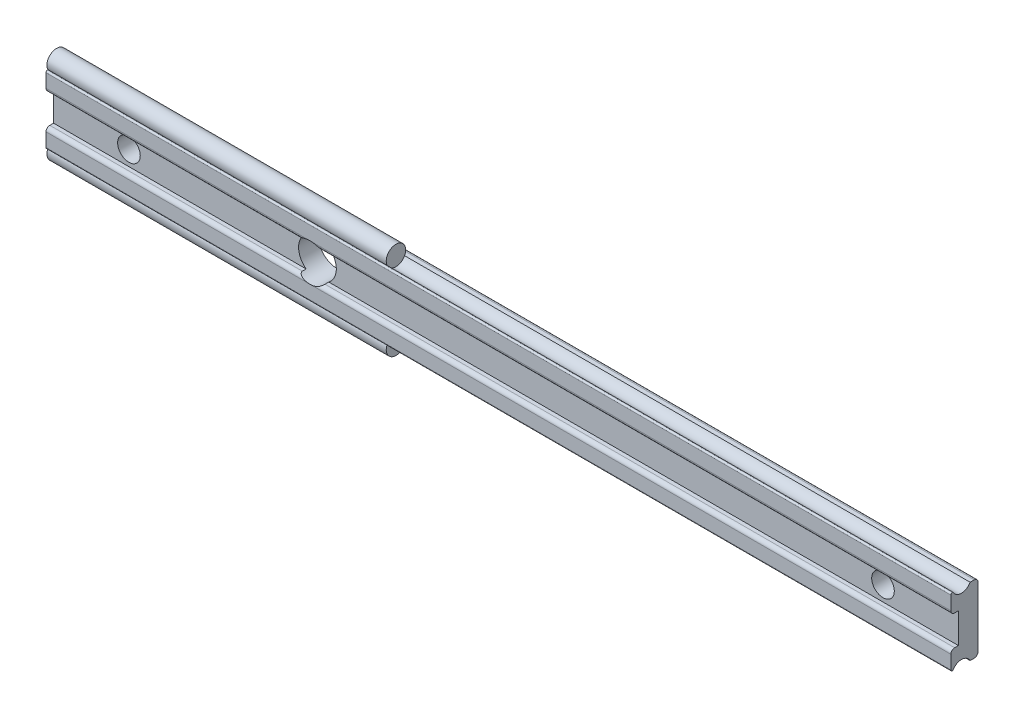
ISO-10303-21;
HEADER;
FILE_DESCRIPTION(('STEP AP214'),'2;1');
FILE_NAME('part.step','',(''),(''),'','','');
FILE_SCHEMA(('AUTOMOTIVE_DESIGN { 1 0 10303 214 1 1 1 1 }'));
ENDSEC;
DATA;
#1=APPLICATION_CONTEXT('core data for automotive mechanical design processes');
#2=APPLICATION_PROTOCOL_DEFINITION('international standard','automotive_design',2000,#1);
#3=PRODUCT_CONTEXT('',#1,'mechanical');
#4=PRODUCT('Part','Part','',(#3));
#5=PRODUCT_RELATED_PRODUCT_CATEGORY('part','',(#4));
#6=PRODUCT_DEFINITION_FORMATION('','',#4);
#7=PRODUCT_DEFINITION_CONTEXT('part definition',#1,'design');
#8=PRODUCT_DEFINITION('design','',#6,#7);
#9=PRODUCT_DEFINITION_SHAPE('','',#8);
#10=(LENGTH_UNIT() NAMED_UNIT(*) SI_UNIT(.MILLI.,.METRE.));
#11=(NAMED_UNIT(*) PLANE_ANGLE_UNIT() SI_UNIT($,.RADIAN.));
#12=(NAMED_UNIT(*) SI_UNIT($,.STERADIAN.) SOLID_ANGLE_UNIT());
#13=UNCERTAINTY_MEASURE_WITH_UNIT(LENGTH_MEASURE(1.E-05),#10,'distance_accuracy_value','');
#14=(GEOMETRIC_REPRESENTATION_CONTEXT(3) GLOBAL_UNCERTAINTY_ASSIGNED_CONTEXT((#13)) GLOBAL_UNIT_ASSIGNED_CONTEXT((#10,
#11,#12)) REPRESENTATION_CONTEXT('',''));
#15=CARTESIAN_POINT('',(0.,0.,0.));
#16=DIRECTION('',(0.,0.,1.));
#17=DIRECTION('',(1.,0.,0.));
#18=AXIS2_PLACEMENT_3D('',#15,#16,#17);
#19=CARTESIAN_POINT('',(-10.,-5.10000002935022,2.18999997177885));
#20=DIRECTION('',(1.,0.,0.));
#21=DIRECTION('',(0.,0.,-1.));
#22=AXIS2_PLACEMENT_3D('',#19,#20,#21);
#23=CYLINDRICAL_SURFACE('',#22,1.28999999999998);
#24=DIRECTION('',(1.,0.,0.));
#25=VECTOR('',#24,1.);
#26=CARTESIAN_POINT('',(-10.,-4.50000002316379,3.33197194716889));
#27=LINE('',#26,#25);
#28=CARTESIAN_POINT('',(35.,-4.50000002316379,3.33197194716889));
#29=VERTEX_POINT('',#28);
#30=CARTESIAN_POINT('',(110.,-4.50000002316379,3.33197194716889));
#31=VERTEX_POINT('',#30);
#32=EDGE_CURVE('E36',#29,#31,#27,.T.);
#33=ORIENTED_EDGE('',*,*,#32,.F.);
#34=CARTESIAN_POINT('',(35.,-5.10000002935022,2.18999997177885));
#35=DIRECTION('',(-1.,0.,0.));
#36=DIRECTION('',(0.,0.,1.));
#37=AXIS2_PLACEMENT_3D('',#34,#35,#36);
#38=CIRCLE('',#37,1.28999999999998);
#39=CARTESIAN_POINT('',(35.,-4.50000002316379,1.04802799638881));
#40=VERTEX_POINT('',#39);
#41=EDGE_CURVE('E31',#29,#40,#38,.T.);
#42=ORIENTED_EDGE('',*,*,#41,.T.);
#43=DIRECTION('',(1.,0.,0.));
#44=VECTOR('',#43,1.);
#45=CARTESIAN_POINT('',(-10.,-4.50000002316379,1.04802799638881));
#46=LINE('',#45,#44);
#47=CARTESIAN_POINT('',(110.,-4.50000002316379,1.04802799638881));
#48=VERTEX_POINT('',#47);
#49=EDGE_CURVE('E199',#40,#48,#46,.T.);
#50=ORIENTED_EDGE('',*,*,#49,.T.);
#51=CARTESIAN_POINT('',(110.,-5.10000002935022,2.18999997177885));
#52=DIRECTION('',(-1.,0.,0.));
#53=DIRECTION('',(0.,0.,1.));
#54=AXIS2_PLACEMENT_3D('',#51,#52,#53);
#55=CIRCLE('',#54,1.28999999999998);
#56=EDGE_CURVE('E343',#31,#48,#55,.T.);
#57=ORIENTED_EDGE('',*,*,#56,.F.);
#58=EDGE_LOOP('',(#33,#42,#50,#57));
#59=FACE_BOUND('',#58,.T.);
#60=ADVANCED_FACE('F14',(#59),#23,.F.);
#61=CARTESIAN_POINT('',(-10.,5.10000002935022,2.18999997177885));
#62=DIRECTION('',(1.,0.,0.));
#63=DIRECTION('',(0.,0.,-1.));
#64=AXIS2_PLACEMENT_3D('',#61,#62,#63);
#65=CYLINDRICAL_SURFACE('',#64,1.28999999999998);
#66=DIRECTION('',(1.,0.,0.));
#67=VECTOR('',#66,1.);
#68=CARTESIAN_POINT('',(-10.,4.50000002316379,1.04802799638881));
#69=LINE('',#68,#67);
#70=CARTESIAN_POINT('',(35.,4.50000002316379,1.04802799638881));
#71=VERTEX_POINT('',#70);
#72=CARTESIAN_POINT('',(110.,4.50000002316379,1.04802799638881));
#73=VERTEX_POINT('',#72);
#74=EDGE_CURVE('E434',#71,#73,#69,.T.);
#75=ORIENTED_EDGE('',*,*,#74,.F.);
#76=CARTESIAN_POINT('',(35.,5.10000002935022,2.18999997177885));
#77=DIRECTION('',(-1.,0.,0.));
#78=DIRECTION('',(0.,0.,1.));
#79=AXIS2_PLACEMENT_3D('',#76,#77,#78);
#80=CIRCLE('',#79,1.28999999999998);
#81=CARTESIAN_POINT('',(35.,4.50000002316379,3.33197194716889));
#82=VERTEX_POINT('',#81);
#83=EDGE_CURVE('E215',#71,#82,#80,.T.);
#84=ORIENTED_EDGE('',*,*,#83,.T.);
#85=DIRECTION('',(1.,0.,0.));
#86=VECTOR('',#85,1.);
#87=CARTESIAN_POINT('',(-10.,4.50000002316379,3.33197194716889));
#88=LINE('',#87,#86);
#89=CARTESIAN_POINT('',(110.,4.50000002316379,3.33197194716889));
#90=VERTEX_POINT('',#89);
#91=EDGE_CURVE('E431',#82,#90,#88,.T.);
#92=ORIENTED_EDGE('',*,*,#91,.T.);
#93=CARTESIAN_POINT('',(110.,5.10000002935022,2.18999997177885));
#94=DIRECTION('',(-1.,0.,0.));
#95=DIRECTION('',(0.,0.,-1.));
#96=AXIS2_PLACEMENT_3D('',#93,#94,#95);
#97=CIRCLE('',#96,1.28999999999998);
#98=EDGE_CURVE('E446',#73,#90,#97,.T.);
#99=ORIENTED_EDGE('',*,*,#98,.F.);
#100=EDGE_LOOP('',(#75,#84,#92,#99));
#101=FACE_BOUND('',#100,.T.);
#102=ADVANCED_FACE('F296',(#101),#65,.F.);
#103=CARTESIAN_POINT('',(-10.,-2.50000002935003,3.0999999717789));
#104=DIRECTION('',(1.,0.,0.));
#105=DIRECTION('',(0.,0.,-1.));
#106=AXIS2_PLACEMENT_3D('',#103,#104,#105);
#107=CYLINDRICAL_SURFACE('',#106,0.5);
#108=CARTESIAN_POINT('',(23.5000000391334,-2.00000002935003,3.0999999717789));
#109=CARTESIAN_POINT('',(23.4999623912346,-1.99996207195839,3.11987287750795));
#110=CARTESIAN_POINT('',(23.5015761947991,-2.00118249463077,3.13968780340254));
#111=CARTESIAN_POINT('',(23.5077735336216,-2.00581273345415,3.17838692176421));
#112=CARTESIAN_POINT('',(23.5123272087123,-2.00920053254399,3.19727844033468));
#113=CARTESIAN_POINT('',(23.524064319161,-2.01783620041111,3.23368112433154));
#114=CARTESIAN_POINT('',(23.5312395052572,-2.02307823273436,3.25119641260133));
#115=CARTESIAN_POINT('',(23.5478060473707,-2.03500322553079,3.28464478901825));
#116=CARTESIAN_POINT('',(23.5572029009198,-2.04168975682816,3.30057381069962));
#117=CARTESIAN_POINT('',(23.5821801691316,-2.05915126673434,3.33710629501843));
#118=CARTESIAN_POINT('',(23.5986909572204,-2.07045578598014,3.35681757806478));
#119=CARTESIAN_POINT('',(23.6343735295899,-2.09416519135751,3.39285662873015));
#120=CARTESIAN_POINT('',(23.6535504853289,-2.10657219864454,3.40917766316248));
#121=CARTESIAN_POINT('',(23.7057779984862,-2.13925431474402,3.44760067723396));
#122=CARTESIAN_POINT('',(23.7403171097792,-2.15983620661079,3.46739923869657));
#123=CARTESIAN_POINT('',(23.8124646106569,-2.20033841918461,3.50112098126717));
#124=CARTESIAN_POINT('',(23.8500797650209,-2.22025713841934,3.51503077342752));
#125=CARTESIAN_POINT('',(23.924642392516,-2.25725862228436,3.53761969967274));
#126=CARTESIAN_POINT('',(23.9614526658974,-2.27444229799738,3.54659655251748));
#127=CARTESIAN_POINT('',(24.036377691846,-2.30718587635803,3.5616792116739));
#128=CARTESIAN_POINT('',(24.0744935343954,-2.32274437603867,3.56778255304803));
#129=CARTESIAN_POINT('',(24.1517657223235,-2.35206511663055,3.57786589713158));
#130=CARTESIAN_POINT('',(24.1909240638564,-2.36582356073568,3.58184146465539));
#131=CARTESIAN_POINT('',(24.2699963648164,-2.3914061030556,3.58824225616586));
#132=CARTESIAN_POINT('',(24.309910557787,-2.40322959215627,3.59066699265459));
#133=CARTESIAN_POINT('',(24.4163047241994,-2.43187057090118,3.59567017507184));
#134=CARTESIAN_POINT('',(24.4832923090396,-2.44698126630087,3.59733638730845));
#135=CARTESIAN_POINT('',(24.6183198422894,-2.47164651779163,3.59934733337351));
#136=CARTESIAN_POINT('',(24.6863603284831,-2.48119813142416,3.59969136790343));
#137=CARTESIAN_POINT('',(24.8231051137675,-2.49468127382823,3.60001763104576));
#138=CARTESIAN_POINT('',(24.8918102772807,-2.49860408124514,3.59999929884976));
#139=CARTESIAN_POINT('',(25.0292885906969,-2.50077334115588,3.60000045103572));
#140=CARTESIAN_POINT('',(25.0980617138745,-2.49902150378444,3.60001992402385));
#141=CARTESIAN_POINT('',(25.2361894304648,-2.48979369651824,3.59991747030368));
#142=CARTESIAN_POINT('',(25.3055387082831,-2.48223803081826,3.59979356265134));
#143=CARTESIAN_POINT('',(25.4434132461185,-2.46135084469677,3.59861400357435));
#144=CARTESIAN_POINT('',(25.5119378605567,-2.44801506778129,3.5975576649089));
#145=CARTESIAN_POINT('',(25.647193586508,-2.41577094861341,3.59312171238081));
#146=CARTESIAN_POINT('',(25.7139325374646,-2.39689392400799,3.58975501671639));
#147=CARTESIAN_POINT('',(25.8452354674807,-2.35378973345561,3.57866700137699));
#148=CARTESIAN_POINT('',(25.9098033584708,-2.32957285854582,3.57095401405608));
#149=CARTESIAN_POINT('',(26.0068972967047,-2.28856748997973,3.55336413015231));
#150=CARTESIAN_POINT('',(26.0405930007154,-2.27343563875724,3.54608306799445));
#151=CARTESIAN_POINT('',(26.1067254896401,-2.24198497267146,3.5286641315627));
#152=CARTESIAN_POINT('',(26.1391613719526,-2.22566533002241,3.51852425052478));
#153=CARTESIAN_POINT('',(26.2024883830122,-2.19210294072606,3.49449855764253));
#154=CARTESIAN_POINT('',(26.233366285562,-2.17485425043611,3.48058554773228));
#155=CARTESIAN_POINT('',(26.2924927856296,-2.14023972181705,3.44804575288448));
#156=CARTESIAN_POINT('',(26.3207460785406,-2.12287415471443,3.4294276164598));
#157=CARTESIAN_POINT('',(26.3636912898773,-2.09540988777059,3.39428778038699));
#158=CARTESIAN_POINT('',(26.3795669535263,-2.08497392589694,3.3794847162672));
#159=CARTESIAN_POINT('',(26.4092206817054,-2.06504577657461,3.34732961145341));
#160=CARTESIAN_POINT('',(26.4230004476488,-2.05555282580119,3.3299796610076));
#161=CARTESIAN_POINT('',(26.4458455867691,-2.03953296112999,3.29562678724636));
#162=CARTESIAN_POINT('',(26.4553118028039,-2.03277439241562,3.27900168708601));
#163=CARTESIAN_POINT('',(26.4718168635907,-2.02085580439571,3.24408352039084));
#164=CARTESIAN_POINT('',(26.4788617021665,-2.01569184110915,3.22579471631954));
#165=CARTESIAN_POINT('',(26.4895121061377,-2.00783357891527,3.18984795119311));
#166=CARTESIAN_POINT('',(26.4933960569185,-2.00494048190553,3.17231727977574));
#167=CARTESIAN_POINT('',(26.4986638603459,-2.00100227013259,3.13654134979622));
#168=CARTESIAN_POINT('',(26.5000272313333,-1.9999722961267,3.11829145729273));
#169=CARTESIAN_POINT('',(26.4999999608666,-2.00000002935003,3.0999999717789));
#170=B_SPLINE_CURVE_WITH_KNOTS('',3,(#108,#109,#110,#111,#112,#113,#114,#115,#116,#117,#118,
#119,#120,#121,#122,#123,#124,#125,#126,#127,#128,#129,#130,#131,#132,#133,#134,#135,#136,#137,
#138,#139,#140,#141,#142,#143,#144,#145,#146,#147,#148,#149,#150,#151,#152,#153,#154,#155,#156,
#157,#158,#159,#160,#161,#162,#163,#164,#165,#166,#167,#168,#169),.UNSPECIFIED.,.F.,.F.,(4,2,2,
2,2,2,2,2,2,2,2,2,2,2,2,2,2,2,2,2,2,2,2,2,2,2,2,2,2,2,4),(0.,0.0594240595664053,
0.118253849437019,0.176900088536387,0.23569299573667,0.319483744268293,0.403439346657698,
0.537132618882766,0.671128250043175,0.795755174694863,0.920488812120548,1.04548144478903,
1.17051334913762,1.37630111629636,1.5821977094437,1.78841297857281,1.99456610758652,
2.20360179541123,2.41279168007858,2.62082132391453,2.82845350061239,2.94128618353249,
3.05419826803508,3.16794695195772,3.28148805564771,3.35355275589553,3.42555863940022,
3.48619419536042,3.54667855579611,3.60096706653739,3.65569480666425),.UNSPECIFIED.);
#171=CARTESIAN_POINT('',(23.5000000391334,-2.00000002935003,3.0999999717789));
#172=VERTEX_POINT('',#171);
#173=CARTESIAN_POINT('',(25.,-2.50000002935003,3.5999999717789));
#174=VERTEX_POINT('',#173);
#175=EDGE_CURVE('E258',#172,#174,#170,.T.);
#176=ORIENTED_EDGE('',*,*,#175,.F.);
#177=DIRECTION('',(1.,0.,0.));
#178=VECTOR('',#177,1.);
#179=CARTESIAN_POINT('',(-10.,-2.00000002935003,3.0999999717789));
#180=LINE('',#179,#178);
#181=CARTESIAN_POINT('',(-10.,-2.00000002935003,3.0999999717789));
#182=VERTEX_POINT('',#181);
#183=EDGE_CURVE('E404',#182,#172,#180,.T.);
#184=ORIENTED_EDGE('',*,*,#183,.F.);
#185=CARTESIAN_POINT('',(-10.,-2.50000002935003,3.0999999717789));
#186=DIRECTION('',(1.,0.,0.));
#187=DIRECTION('',(0.,0.,1.));
#188=AXIS2_PLACEMENT_3D('',#185,#186,#187);
#189=CIRCLE('',#188,0.5);
#190=CARTESIAN_POINT('',(-10.,-2.50000002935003,3.5999999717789));
#191=VERTEX_POINT('',#190);
#192=EDGE_CURVE('E381',#182,#191,#189,.T.);
#193=ORIENTED_EDGE('',*,*,#192,.T.);
#194=DIRECTION('',(1.,0.,0.));
#195=VECTOR('',#194,1.);
#196=CARTESIAN_POINT('',(-10.,-2.50000002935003,3.5999999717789));
#197=LINE('',#196,#195);
#198=EDGE_CURVE('E400',#191,#174,#197,.T.);
#199=ORIENTED_EDGE('',*,*,#198,.T.);
#200=EDGE_LOOP('',(#176,#184,#193,#199));
#201=FACE_BOUND('',#200,.T.);
#202=ADVANCED_FACE('F271',(#201),#107,.T.);
#203=CARTESIAN_POINT('',(-10.,-2.00000002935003,3.0999999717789));
#204=DIRECTION('',(0.,1.,0.));
#205=DIRECTION('',(1.,0.,0.));
#206=AXIS2_PLACEMENT_3D('',#203,#204,#205);
#207=PLANE('',#206);
#208=DIRECTION('',(0.,0.,-1.));
#209=VECTOR('',#208,1.);
#210=CARTESIAN_POINT('',(26.4999999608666,-2.00000002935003,3.5999999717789));
#211=LINE('',#210,#209);
#212=CARTESIAN_POINT('',(26.4999999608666,-2.00000002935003,3.0999999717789));
#213=VERTEX_POINT('',#212);
#214=CARTESIAN_POINT('',(26.4999999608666,-2.00000002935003,2.59999996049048));
#215=VERTEX_POINT('',#214);
#216=EDGE_CURVE('E259',#213,#215,#211,.T.);
#217=ORIENTED_EDGE('',*,*,#216,.F.);
#218=CARTESIAN_POINT('',(110.,-2.00000002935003,3.0999999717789));
#219=VERTEX_POINT('',#218);
#220=EDGE_CURVE('E407',#213,#219,#180,.T.);
#221=ORIENTED_EDGE('',*,*,#220,.T.);
#222=DIRECTION('',(0.,0.,1.));
#223=VECTOR('',#222,1.);
#224=CARTESIAN_POINT('',(110.,-2.00000002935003,3.0999999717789));
#225=LINE('',#224,#223);
#226=CARTESIAN_POINT('',(110.,-2.00000002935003,2.59999996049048));
#227=VERTEX_POINT('',#226);
#228=EDGE_CURVE('E338',#227,#219,#225,.T.);
#229=ORIENTED_EDGE('',*,*,#228,.F.);
#230=DIRECTION('',(1.,0.,0.));
#231=VECTOR('',#230,1.);
#232=CARTESIAN_POINT('',(-10.,-2.00000002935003,2.59999996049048));
#233=LINE('',#232,#231);
#234=EDGE_CURVE('E411',#215,#227,#233,.T.);
#235=ORIENTED_EDGE('',*,*,#234,.F.);
#236=EDGE_LOOP('',(#217,#221,#229,#235));
#237=FACE_BOUND('',#236,.T.);
#238=ADVANCED_FACE('F277',(#237),#207,.T.);
#239=CARTESIAN_POINT('',(-10.,-2.00000002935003,2.59999996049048));
#240=DIRECTION('',(0.,0.,1.));
#241=DIRECTION('',(1.,0.,0.));
#242=AXIS2_PLACEMENT_3D('',#239,#240,#241);
#243=PLANE('',#242);
#244=CARTESIAN_POINT('',(0.,0.,2.59999996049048));
#245=DIRECTION('',(0.,0.,1.));
#246=DIRECTION('',(1.,0.,0.));
#247=AXIS2_PLACEMENT_3D('',#244,#245,#246);
#248=CIRCLE('',#247,1.5);
#249=CARTESIAN_POINT('',(1.5,0.,2.59999996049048));
#250=VERTEX_POINT('',#249);
#251=EDGE_CURVE('E716',#250,#250,#248,.T.);
#252=ORIENTED_EDGE('',*,*,#251,.F.);
#253=EDGE_LOOP('',(#252));
#254=FACE_BOUND('',#253,.T.);
#255=CARTESIAN_POINT('',(25.,0.,2.59999996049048));
#256=DIRECTION('',(0.,0.,1.));
#257=DIRECTION('',(1.,0.,0.));
#258=AXIS2_PLACEMENT_3D('',#255,#256,#257);
#259=CIRCLE('',#258,2.5);
#260=CARTESIAN_POINT('',(23.5000000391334,2.00000002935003,2.59999996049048));
#261=VERTEX_POINT('',#260);
#262=CARTESIAN_POINT('',(23.5000000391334,-2.00000002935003,2.59999996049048));
#263=VERTEX_POINT('',#262);
#264=EDGE_CURVE('E485',#261,#263,#259,.T.);
#265=ORIENTED_EDGE('',*,*,#264,.F.);
#266=DIRECTION('',(1.,0.,0.));
#267=VECTOR('',#266,1.);
#268=CARTESIAN_POINT('',(-10.,2.00000002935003,2.59999996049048));
#269=LINE('',#268,#267);
#270=CARTESIAN_POINT('',(-10.,2.00000002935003,2.59999996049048));
#271=VERTEX_POINT('',#270);
#272=EDGE_CURVE('E412',#271,#261,#269,.T.);
#273=ORIENTED_EDGE('',*,*,#272,.F.);
#274=DIRECTION('',(0.,-1.,0.));
#275=VECTOR('',#274,1.);
#276=CARTESIAN_POINT('',(-10.,-2.00000002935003,2.59999996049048));
#277=LINE('',#276,#275);
#278=CARTESIAN_POINT('',(-10.,-2.00000002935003,2.59999996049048));
#279=VERTEX_POINT('',#278);
#280=EDGE_CURVE('E375',#271,#279,#277,.T.);
#281=ORIENTED_EDGE('',*,*,#280,.T.);
#282=EDGE_CURVE('E408',#279,#263,#233,.T.);
#283=ORIENTED_EDGE('',*,*,#282,.T.);
#284=EDGE_LOOP('',(#265,#273,#281,#283));
#285=FACE_BOUND('',#284,.T.);
#286=ADVANCED_FACE('F281',(#254,#285),#243,.T.);
#287=CARTESIAN_POINT('',(-10.,2.00000002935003,3.0999999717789));
#288=DIRECTION('',(0.,-1.,0.));
#289=DIRECTION('',(-1.,0.,0.));
#290=AXIS2_PLACEMENT_3D('',#287,#288,#289);
#291=PLANE('',#290);
#292=DIRECTION('',(0.,0.,-1.));
#293=VECTOR('',#292,1.);
#294=CARTESIAN_POINT('',(23.5000000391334,2.00000002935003,3.5999999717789));
#295=LINE('',#294,#293);
#296=CARTESIAN_POINT('',(23.500000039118,2.00000002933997,3.09999997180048));
#297=VERTEX_POINT('',#296);
#298=EDGE_CURVE('E489',#297,#261,#295,.T.);
#299=ORIENTED_EDGE('',*,*,#298,.F.);
#300=DIRECTION('',(1.,0.,0.));
#301=VECTOR('',#300,1.);
#302=CARTESIAN_POINT('',(-10.,2.00000002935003,3.0999999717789));
#303=LINE('',#302,#301);
#304=CARTESIAN_POINT('',(-10.,2.00000002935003,3.0999999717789));
#305=VERTEX_POINT('',#304);
#306=EDGE_CURVE('E416',#305,#297,#303,.T.);
#307=ORIENTED_EDGE('',*,*,#306,.F.);
#308=DIRECTION('',(0.,0.,-1.));
#309=VECTOR('',#308,1.);
#310=CARTESIAN_POINT('',(-10.,2.00000002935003,3.0999999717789));
#311=LINE('',#310,#309);
#312=EDGE_CURVE('E372',#305,#271,#311,.T.);
#313=ORIENTED_EDGE('',*,*,#312,.T.);
#314=ORIENTED_EDGE('',*,*,#272,.T.);
#315=EDGE_LOOP('',(#299,#307,#313,#314));
#316=FACE_BOUND('',#315,.T.);
#317=ADVANCED_FACE('F284',(#316),#291,.T.);
#318=CARTESIAN_POINT('',(-10.,2.50000002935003,3.0999999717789));
#319=DIRECTION('',(1.,0.,0.));
#320=DIRECTION('',(0.,0.,-1.));
#321=AXIS2_PLACEMENT_3D('',#318,#319,#320);
#322=CYLINDRICAL_SURFACE('',#321,0.5);
#323=CARTESIAN_POINT('',(25.,2.50000002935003,2.5999999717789));
#324=CARTESIAN_POINT('',(25.069780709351,2.49999961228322,2.59999684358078));
#325=CARTESIAN_POINT('',(25.1395723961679,2.49707593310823,2.59997347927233));
#326=CARTESIAN_POINT('',(25.2787151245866,2.48539690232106,2.6001800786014));
#327=CARTESIAN_POINT('',(25.348065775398,2.47663695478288,2.60041024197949));
#328=CARTESIAN_POINT('',(25.4859229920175,2.45331869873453,2.60204582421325));
#329=CARTESIAN_POINT('',(25.5544276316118,2.43874903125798,2.60345355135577));
#330=CARTESIAN_POINT('',(25.6898082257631,2.40396478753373,2.60899333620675));
#331=CARTESIAN_POINT('',(25.756685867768,2.38375635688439,2.61312243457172));
#332=CARTESIAN_POINT('',(25.8878611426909,2.33805107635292,2.62635222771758));
#333=CARTESIAN_POINT('',(25.9521694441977,2.31257958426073,2.6354294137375));
#334=CARTESIAN_POINT('',(26.0456684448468,2.2710659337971,2.65523231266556));
#335=CARTESIAN_POINT('',(26.0762719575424,2.25671479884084,2.66283922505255));
#336=CARTESIAN_POINT('',(26.1362469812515,2.22711837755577,2.68067268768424));
#337=CARTESIAN_POINT('',(26.1656196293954,2.21187394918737,2.6908967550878));
#338=CARTESIAN_POINT('',(26.2198533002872,2.18238701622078,2.71343738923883));
#339=CARTESIAN_POINT('',(26.2448711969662,2.16819760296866,2.72544077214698));
#340=CARTESIAN_POINT('',(26.2931470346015,2.13975590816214,2.75270629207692));
#341=CARTESIAN_POINT('',(26.3164016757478,2.12550355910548,2.76797434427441));
#342=CARTESIAN_POINT('',(26.3606798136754,2.09743792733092,2.80259720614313));
#343=CARTESIAN_POINT('',(26.3816675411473,2.08363357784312,2.82200620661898));
#344=CARTESIAN_POINT('',(26.4198250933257,2.05782015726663,2.86525768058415));
#345=CARTESIAN_POINT('',(26.4370109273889,2.04580363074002,2.88908075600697));
#346=CARTESIAN_POINT('',(26.4601638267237,2.02929472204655,2.93054582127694));
#347=CARTESIAN_POINT('',(26.4678583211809,2.02372383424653,2.94679690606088));
#348=CARTESIAN_POINT('',(26.4809806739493,2.01414052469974,2.98063213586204));
#349=CARTESIAN_POINT('',(26.4864099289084,2.01012714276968,2.99821545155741));
#350=CARTESIAN_POINT('',(26.4946932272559,2.00397599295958,3.0344307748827));
#351=CARTESIAN_POINT('',(26.4975302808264,2.00185060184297,3.05306886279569));
#352=CARTESIAN_POINT('',(26.5003573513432,1.99973280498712,3.09067994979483));
#353=CARTESIAN_POINT('',(26.5003484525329,1.99973958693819,3.10965281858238));
#354=CARTESIAN_POINT('',(26.497624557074,2.00177987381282,3.14547864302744));
#355=CARTESIAN_POINT('',(26.4951642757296,2.00362260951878,3.16236308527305));
#356=CARTESIAN_POINT('',(26.4880645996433,2.00890097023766,3.195403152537));
#357=CARTESIAN_POINT('',(26.4834248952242,2.01233682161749,3.21155867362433));
#358=CARTESIAN_POINT('',(26.4720098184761,2.02070243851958,3.24336707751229));
#359=CARTESIAN_POINT('',(26.465164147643,2.02568113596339,3.2589814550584));
#360=CARTESIAN_POINT('',(26.4497114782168,2.03676887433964,3.28886889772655));
#361=CARTESIAN_POINT('',(26.4411036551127,2.04287844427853,3.30314133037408));
#362=CARTESIAN_POINT('',(26.4169435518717,2.05975585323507,3.33823463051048));
#363=CARTESIAN_POINT('',(26.4002789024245,2.07115448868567,3.35798793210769));
#364=CARTESIAN_POINT('',(26.3642668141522,2.09505326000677,3.39409026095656));
#365=CARTESIAN_POINT('',(26.3449122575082,2.10755628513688,3.4104299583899));
#366=CARTESIAN_POINT('',(26.2922096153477,2.14047625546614,3.44887366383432));
#367=CARTESIAN_POINT('',(26.2573666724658,2.16119156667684,3.46865418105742));
#368=CARTESIAN_POINT('',(26.1846096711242,2.2019210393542,3.50230255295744));
#369=CARTESIAN_POINT('',(26.1466891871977,2.22193360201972,3.51615763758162));
#370=CARTESIAN_POINT('',(26.0714819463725,2.25910706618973,3.53864276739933));
#371=CARTESIAN_POINT('',(26.0343299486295,2.27636940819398,3.54756588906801));
#372=CARTESIAN_POINT('',(25.9587172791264,2.30923445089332,3.56253063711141));
#373=CARTESIAN_POINT('',(25.9202555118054,2.32483571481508,3.5685697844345));
#374=CARTESIAN_POINT('',(25.8422841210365,2.35420842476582,3.57852429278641));
#375=CARTESIAN_POINT('',(25.8027723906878,2.36797579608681,3.5824349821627));
#376=CARTESIAN_POINT('',(25.7229920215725,2.39354107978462,3.58871158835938));
#377=CARTESIAN_POINT('',(25.682723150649,2.40533837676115,3.59107702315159));
#378=CARTESIAN_POINT('',(25.5757687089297,2.43376380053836,3.59591989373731));
#379=CARTESIAN_POINT('',(25.5085845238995,2.4486867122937,3.59751014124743));
#380=CARTESIAN_POINT('',(25.373180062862,2.47294830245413,3.59941453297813));
#381=CARTESIAN_POINT('',(25.3049592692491,2.48228409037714,3.59972801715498));
#382=CARTESIAN_POINT('',(25.1679315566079,2.49530310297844,3.60002072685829));
#383=CARTESIAN_POINT('',(25.0991242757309,2.49898253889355,3.59999972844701));
#384=CARTESIAN_POINT('',(24.9614619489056,2.50065037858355,3.60000014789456));
#385=CARTESIAN_POINT('',(24.892606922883,2.49864045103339,3.6000215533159));
#386=CARTESIAN_POINT('',(24.7545108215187,2.48889147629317,3.59990066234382));
#387=CARTESIAN_POINT('',(24.6852743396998,2.4810871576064,3.59975649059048));
#388=CARTESIAN_POINT('',(24.5476490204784,2.45972182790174,3.59849012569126));
#389=CARTESIAN_POINT('',(24.4792608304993,2.44615666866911,3.59736722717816));
#390=CARTESIAN_POINT('',(24.3439854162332,2.41339584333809,3.59272083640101));
#391=CARTESIAN_POINT('',(24.2770966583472,2.39420624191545,3.58919992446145));
#392=CARTESIAN_POINT('',(24.1455781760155,2.35047976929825,3.57765819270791));
#393=CARTESIAN_POINT('',(24.0809445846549,2.32595263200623,3.56964552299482));
#394=CARTESIAN_POINT('',(23.9614239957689,2.27488794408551,3.54724040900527));
#395=CARTESIAN_POINT('',(23.9062176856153,2.24881546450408,3.53358757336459));
#396=CARTESIAN_POINT('',(23.8269591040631,2.20790883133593,3.50613518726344));
#397=CARTESIAN_POINT('',(23.8012028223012,2.1940176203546,3.49586302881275));
#398=CARTESIAN_POINT('',(23.7511989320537,2.1659437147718,3.4724795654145));
#399=CARTESIAN_POINT('',(23.7269491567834,2.15176147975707,3.45937246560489));
#400=CARTESIAN_POINT('',(23.6853213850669,2.12651940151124,3.43282676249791));
#401=CARTESIAN_POINT('',(23.6675631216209,2.11542361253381,3.42002403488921));
#402=CARTESIAN_POINT('',(23.6336986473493,2.09371073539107,3.39196563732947));
#403=CARTESIAN_POINT('',(23.617594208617,2.08309416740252,3.37670738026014));
#404=CARTESIAN_POINT('',(23.5874473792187,2.06277214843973,3.34334601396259));
#405=CARTESIAN_POINT('',(23.5734283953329,2.05307742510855,3.32521473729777));
#406=CARTESIAN_POINT('',(23.548421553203,2.03547394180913,3.28619898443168));
#407=CARTESIAN_POINT('',(23.5374266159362,2.02756101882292,3.26532111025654));
#408=CARTESIAN_POINT('',(23.5218205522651,2.01619736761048,3.22732618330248));
#409=CARTESIAN_POINT('',(23.5162844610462,2.01211769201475,3.21077709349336));
#410=CARTESIAN_POINT('',(23.5075194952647,2.00562509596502,3.17676126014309));
#411=CARTESIAN_POINT('',(23.5042891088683,2.0032110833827,3.15929512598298));
#412=CARTESIAN_POINT('',(23.5003337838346,2.00025191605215,3.12385463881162));
#413=CARTESIAN_POINT('',(23.4996181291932,1.99971368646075,3.10587864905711));
#414=CARTESIAN_POINT('',(23.5007681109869,2.00057596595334,3.0700567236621));
#415=CARTESIAN_POINT('',(23.5026338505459,2.00197655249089,3.05221079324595));
#416=CARTESIAN_POINT('',(23.5086526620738,2.00646351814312,3.01813721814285));
#417=CARTESIAN_POINT('',(23.5126783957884,2.00945597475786,3.0018740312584));
#418=CARTESIAN_POINT('',(23.5227062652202,2.01683957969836,2.97031120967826));
#419=CARTESIAN_POINT('',(23.5287090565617,2.02123119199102,2.95501189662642));
#420=CARTESIAN_POINT('',(23.5449788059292,2.03298963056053,2.92012689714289));
#421=CARTESIAN_POINT('',(23.5560014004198,2.04085558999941,2.90106185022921));
#422=CARTESIAN_POINT('',(23.5805769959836,2.0580243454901,2.86536857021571));
#423=CARTESIAN_POINT('',(23.5941350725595,2.06733001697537,2.84874534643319));
#424=CARTESIAN_POINT('',(23.6299444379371,2.09131494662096,2.81070475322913));
#425=CARTESIAN_POINT('',(23.6533074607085,2.10648162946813,2.79064977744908));
#426=CARTESIAN_POINT('',(23.7028534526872,2.13735094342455,2.75497203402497));
#427=CARTESIAN_POINT('',(23.7290417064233,2.15305454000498,2.7393577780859));
#428=CARTESIAN_POINT('',(23.7795657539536,2.18203276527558,2.71371523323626));
#429=CARTESIAN_POINT('',(23.8036475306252,2.195339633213,2.7032109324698));
#430=CARTESIAN_POINT('',(23.8529228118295,2.22148472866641,2.68444296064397));
#431=CARTESIAN_POINT('',(23.8781171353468,2.23432259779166,2.67618097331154));
#432=CARTESIAN_POINT('',(23.9550874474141,2.27187370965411,2.6541201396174));
#433=CARTESIAN_POINT('',(24.0081550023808,2.29556896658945,2.64309056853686));
#434=CARTESIAN_POINT('',(24.113995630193,2.33840201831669,2.62630514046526));
#435=CARTESIAN_POINT('',(24.1666763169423,2.35769592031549,2.620336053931));
#436=CARTESIAN_POINT('',(24.2734821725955,2.39276663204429,2.61129875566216));
#437=CARTESIAN_POINT('',(24.3276086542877,2.40854011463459,2.60823327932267));
#438=CARTESIAN_POINT('',(24.4368305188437,2.43639429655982,2.60386249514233));
#439=CARTESIAN_POINT('',(24.4919253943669,2.44847687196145,2.60255629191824));
#440=CARTESIAN_POINT('',(24.6027870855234,2.46888568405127,2.60086397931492));
#441=CARTESIAN_POINT('',(24.6585535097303,2.4772140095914,2.60047735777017));
#442=CARTESIAN_POINT('',(24.7619103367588,2.48909375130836,2.60008975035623));
#443=CARTESIAN_POINT('',(24.8094395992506,2.49318272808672,2.60003861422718));
#444=CARTESIAN_POINT('',(24.9046442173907,2.49863577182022,2.59999479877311));
#445=CARTESIAN_POINT('',(24.9523195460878,2.50000031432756,2.60000210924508));
#446=CARTESIAN_POINT('',(25.,2.50000002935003,2.5999999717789));
#447=B_SPLINE_CURVE_WITH_KNOTS('',3,(#323,#324,#325,#326,#327,#328,#329,#330,#331,#332,#333,
#334,#335,#336,#337,#338,#339,#340,#341,#342,#343,#344,#345,#346,#347,#348,#349,#350,#351,#352,
#353,#354,#355,#356,#357,#358,#359,#360,#361,#362,#363,#364,#365,#366,#367,#368,#369,#370,#371,
#372,#373,#374,#375,#376,#377,#378,#379,#380,#381,#382,#383,#384,#385,#386,#387,#388,#389,#390,
#391,#392,#393,#394,#395,#396,#397,#398,#399,#400,#401,#402,#403,#404,#405,#406,#407,#408,#409,
#410,#411,#412,#413,#414,#415,#416,#417,#418,#419,#420,#421,#422,#423,#424,#425,#426,#427,#428,
#429,#430,#431,#432,#433,#434,#435,#436,#437,#438,#439,#440,#441,#442,#443,#444,#445,#446),
.UNSPECIFIED.,.T.,.F.,(4,2,2,2,2,2,2,2,2,2,2,2,2,2,2,2,2,2,2,2,2,2,2,2,2,2,2,2,2,2,2,2,2,2,2,2,
2,2,2,2,2,2,2,2,2,2,2,2,2,2,2,2,2,2,2,2,2,2,2,2,2,4),(0.,0.209299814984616,0.418764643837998,
0.62864103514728,0.838289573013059,1.04695062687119,1.15079109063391,1.25453340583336,
1.34785907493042,1.44135529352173,1.53615966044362,1.63055687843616,1.68681937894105,
1.74304713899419,1.79964083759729,1.85621297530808,1.90746182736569,1.95871796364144,
2.01180304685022,2.06491302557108,2.14916554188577,2.23364540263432,2.36819630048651,
2.50303572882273,2.62863165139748,2.75433534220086,2.88031383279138,3.00633160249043,
3.21256676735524,3.41890853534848,3.62538845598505,3.83180782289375,4.04058838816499,
4.2495195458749,4.45822624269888,4.66655547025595,4.8534920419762,4.94640888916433,
5.03918884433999,5.11267285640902,5.18623480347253,5.26056853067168,5.33472673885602,
5.38826947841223,5.44177707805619,5.49548201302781,5.5491890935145,5.60003092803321,
5.65088963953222,5.72065337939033,5.79055829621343,5.89295139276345,5.99553944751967,
6.08376383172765,6.17205428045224,6.34898886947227,6.51803376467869,6.68723775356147,
6.85635559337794,7.02537922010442,7.16841663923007,7.31142908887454),.UNSPECIFIED.);
#448=CARTESIAN_POINT('',(26.499999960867,2.00000002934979,3.09999997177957));
#449=VERTEX_POINT('',#448);
#450=CARTESIAN_POINT('',(25.,2.50000002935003,3.5999999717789));
#451=VERTEX_POINT('',#450);
#452=EDGE_CURVE('E231',#449,#451,#447,.T.);
#453=ORIENTED_EDGE('',*,*,#452,.F.);
#454=CARTESIAN_POINT('',(110.,2.00000002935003,3.0999999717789));
#455=VERTEX_POINT('',#454);
#456=EDGE_CURVE('E419',#449,#455,#303,.T.);
#457=ORIENTED_EDGE('',*,*,#456,.T.);
#458=CARTESIAN_POINT('',(110.,2.50000002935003,3.0999999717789));
#459=DIRECTION('',(1.,0.,0.));
#460=DIRECTION('',(0.,0.,-1.));
#461=AXIS2_PLACEMENT_3D('',#458,#459,#460);
#462=CIRCLE('',#461,0.5);
#463=CARTESIAN_POINT('',(110.,2.50000002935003,3.5999999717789));
#464=VERTEX_POINT('',#463);
#465=EDGE_CURVE('E460',#464,#455,#462,.T.);
#466=ORIENTED_EDGE('',*,*,#465,.F.);
#467=DIRECTION('',(1.,0.,0.));
#468=VECTOR('',#467,1.);
#469=CARTESIAN_POINT('',(-10.,2.50000002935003,3.5999999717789));
#470=LINE('',#469,#468);
#471=EDGE_CURVE('E423',#451,#464,#470,.T.);
#472=ORIENTED_EDGE('',*,*,#471,.F.);
#473=EDGE_LOOP('',(#453,#457,#466,#472));
#474=FACE_BOUND('',#473,.T.);
#475=ADVANCED_FACE('F291',(#474),#322,.T.);
#476=CARTESIAN_POINT('',(-10.,4.00000002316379,0.5));
#477=DIRECTION('',(1.,0.,0.));
#478=DIRECTION('',(0.,0.,-1.));
#479=AXIS2_PLACEMENT_3D('',#476,#477,#478);
#480=CYLINDRICAL_SURFACE('',#479,0.5);
#481=CARTESIAN_POINT('',(110.,4.00000002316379,0.5));
#482=DIRECTION('',(1.,0.,0.));
#483=DIRECTION('',(0.,0.,-1.));
#484=AXIS2_PLACEMENT_3D('',#481,#482,#483);
#485=CIRCLE('',#484,0.5);
#486=CARTESIAN_POINT('',(110.,4.00000002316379,0.));
#487=VERTEX_POINT('',#486);
#488=CARTESIAN_POINT('',(110.,4.50000002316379,0.5));
#489=VERTEX_POINT('',#488);
#490=EDGE_CURVE('E261',#487,#489,#485,.T.);
#491=ORIENTED_EDGE('',*,*,#490,.F.);
#492=DIRECTION('',(1.,0.,0.));
#493=VECTOR('',#492,1.);
#494=CARTESIAN_POINT('',(-10.,4.00000002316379,0.));
#495=LINE('',#494,#493);
#496=CARTESIAN_POINT('',(-10.,4.00000002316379,0.));
#497=VERTEX_POINT('',#496);
#498=EDGE_CURVE('E9',#497,#487,#495,.T.);
#499=ORIENTED_EDGE('',*,*,#498,.F.);
#500=CARTESIAN_POINT('',(-10.,4.00000002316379,0.5));
#501=DIRECTION('',(1.,0.,0.));
#502=DIRECTION('',(0.,0.,-1.));
#503=AXIS2_PLACEMENT_3D('',#500,#501,#502);
#504=CIRCLE('',#503,0.5);
#505=CARTESIAN_POINT('',(-10.,4.50000002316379,0.5));
#506=VERTEX_POINT('',#505);
#507=EDGE_CURVE('E355',#497,#506,#504,.T.);
#508=ORIENTED_EDGE('',*,*,#507,.T.);
#509=DIRECTION('',(1.,0.,0.));
#510=VECTOR('',#509,1.);
#511=CARTESIAN_POINT('',(-10.,4.50000002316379,0.5));
#512=LINE('',#511,#510);
#513=EDGE_CURVE('E393',#506,#489,#512,.T.);
#514=ORIENTED_EDGE('',*,*,#513,.T.);
#515=EDGE_LOOP('',(#491,#499,#508,#514));
#516=FACE_BOUND('',#515,.T.);
#517=ADVANCED_FACE('F16',(#516),#480,.T.);
#518=CARTESIAN_POINT('',(-10.,-4.00000002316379,0.));
#519=DIRECTION('',(0.,0.,-1.));
#520=DIRECTION('',(-1.,0.,0.));
#521=AXIS2_PLACEMENT_3D('',#518,#519,#520);
#522=PLANE('',#521);
#523=CARTESIAN_POINT('',(0.,0.,0.));
#524=DIRECTION('',(0.,0.,-1.));
#525=DIRECTION('',(-1.,0.,0.));
#526=AXIS2_PLACEMENT_3D('',#523,#524,#525);
#527=CIRCLE('',#526,1.5);
#528=CARTESIAN_POINT('',(-1.5,0.,0.));
#529=VERTEX_POINT('',#528);
#530=EDGE_CURVE('E18',#529,#529,#527,.T.);
#531=ORIENTED_EDGE('',*,*,#530,.F.);
#532=EDGE_LOOP('',(#531));
#533=FACE_BOUND('',#532,.T.);
#534=CARTESIAN_POINT('',(100.,0.,0.));
#535=DIRECTION('',(0.,0.,-1.));
#536=DIRECTION('',(-1.,0.,0.));
#537=AXIS2_PLACEMENT_3D('',#534,#535,#536);
#538=CIRCLE('',#537,1.5);
#539=CARTESIAN_POINT('',(98.5,0.,0.));
#540=VERTEX_POINT('',#539);
#541=EDGE_CURVE('E212',#540,#540,#538,.T.);
#542=ORIENTED_EDGE('',*,*,#541,.F.);
#543=EDGE_LOOP('',(#542));
#544=FACE_BOUND('',#543,.T.);
#545=CARTESIAN_POINT('',(25.,0.,0.));
#546=DIRECTION('',(0.,0.,-1.));
#547=DIRECTION('',(-1.,0.,0.));
#548=AXIS2_PLACEMENT_3D('',#545,#546,#547);
#549=CIRCLE('',#548,2.5);
#550=CARTESIAN_POINT('',(22.5,0.,0.));
#551=VERTEX_POINT('',#550);
#552=EDGE_CURVE('E217',#551,#551,#549,.T.);
#553=ORIENTED_EDGE('',*,*,#552,.F.);
#554=EDGE_LOOP('',(#553));
#555=FACE_BOUND('',#554,.T.);
#556=DIRECTION('',(0.,1.,0.));
#557=VECTOR('',#556,1.);
#558=CARTESIAN_POINT('',(110.,-4.00000002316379,0.));
#559=LINE('',#558,#557);
#560=CARTESIAN_POINT('',(110.,-4.00000002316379,0.));
#561=VERTEX_POINT('',#560);
#562=EDGE_CURVE('E352',#561,#487,#559,.T.);
#563=ORIENTED_EDGE('',*,*,#562,.F.);
#564=DIRECTION('',(1.,0.,0.));
#565=VECTOR('',#564,1.);
#566=CARTESIAN_POINT('',(-10.,-4.00000002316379,0.));
#567=LINE('',#566,#565);
#568=CARTESIAN_POINT('',(-10.,-4.00000002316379,0.));
#569=VERTEX_POINT('',#568);
#570=EDGE_CURVE('E23',#569,#561,#567,.T.);
#571=ORIENTED_EDGE('',*,*,#570,.F.);
#572=DIRECTION('',(0.,1.,0.));
#573=VECTOR('',#572,1.);
#574=CARTESIAN_POINT('',(-10.,-4.00000002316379,0.));
#575=LINE('',#574,#573);
#576=EDGE_CURVE('E391',#569,#497,#575,.T.);
#577=ORIENTED_EDGE('',*,*,#576,.T.);
#578=ORIENTED_EDGE('',*,*,#498,.T.);
#579=EDGE_LOOP('',(#563,#571,#577,#578));
#580=FACE_BOUND('',#579,.T.);
#581=ADVANCED_FACE('F508',(#533,#544,#555,#580),#522,.T.);
#582=CARTESIAN_POINT('',(-10.,-4.00000002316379,0.5));
#583=DIRECTION('',(1.,0.,0.));
#584=DIRECTION('',(0.,0.,-1.));
#585=AXIS2_PLACEMENT_3D('',#582,#583,#584);
#586=CYLINDRICAL_SURFACE('',#585,0.5);
#587=CARTESIAN_POINT('',(110.,-4.00000002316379,0.5));
#588=DIRECTION('',(1.,0.,0.));
#589=DIRECTION('',(0.,0.,1.));
#590=AXIS2_PLACEMENT_3D('',#587,#588,#589);
#591=CIRCLE('',#590,0.5);
#592=CARTESIAN_POINT('',(110.,-4.50000002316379,0.5));
#593=VERTEX_POINT('',#592);
#594=EDGE_CURVE('E349',#593,#561,#591,.T.);
#595=ORIENTED_EDGE('',*,*,#594,.F.);
#596=DIRECTION('',(1.,0.,0.));
#597=VECTOR('',#596,1.);
#598=CARTESIAN_POINT('',(-10.,-4.50000002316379,0.5));
#599=LINE('',#598,#597);
#600=CARTESIAN_POINT('',(-10.,-4.50000002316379,0.5));
#601=VERTEX_POINT('',#600);
#602=EDGE_CURVE('E203',#601,#593,#599,.T.);
#603=ORIENTED_EDGE('',*,*,#602,.F.);
#604=CARTESIAN_POINT('',(-10.,-4.00000002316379,0.5));
#605=DIRECTION('',(1.,0.,0.));
#606=DIRECTION('',(0.,0.,1.));
#607=AXIS2_PLACEMENT_3D('',#604,#605,#606);
#608=CIRCLE('',#607,0.5);
#609=EDGE_CURVE('E191',#601,#569,#608,.T.);
#610=ORIENTED_EDGE('',*,*,#609,.T.);
#611=ORIENTED_EDGE('',*,*,#570,.T.);
#612=EDGE_LOOP('',(#595,#603,#610,#611));
#613=FACE_BOUND('',#612,.T.);
#614=ADVANCED_FACE('F511',(#613),#586,.T.);
#615=CARTESIAN_POINT('',(-10.,-4.50000002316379,1.04802799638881));
#616=DIRECTION('',(0.,-1.,0.));
#617=DIRECTION('',(-1.,0.,0.));
#618=AXIS2_PLACEMENT_3D('',#615,#616,#617);
#619=PLANE('',#618);
#620=DIRECTION('',(0.,0.,-1.));
#621=VECTOR('',#620,1.);
#622=CARTESIAN_POINT('',(110.,-4.50000002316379,1.04802799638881));
#623=LINE('',#622,#621);
#624=EDGE_CURVE('E346',#48,#593,#623,.T.);
#625=ORIENTED_EDGE('',*,*,#624,.F.);
#626=ORIENTED_EDGE('',*,*,#49,.F.);
#627=CARTESIAN_POINT('',(-10.,-4.50000002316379,1.04802799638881));
#628=VERTEX_POINT('',#627);
#629=EDGE_CURVE('E196',#628,#40,#46,.T.);
#630=ORIENTED_EDGE('',*,*,#629,.F.);
#631=DIRECTION('',(0.,0.,-1.));
#632=VECTOR('',#631,1.);
#633=CARTESIAN_POINT('',(-10.,-4.50000002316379,1.04802799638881));
#634=LINE('',#633,#632);
#635=EDGE_CURVE('E182',#628,#601,#634,.T.);
#636=ORIENTED_EDGE('',*,*,#635,.T.);
#637=ORIENTED_EDGE('',*,*,#602,.T.);
#638=EDGE_LOOP('',(#625,#626,#630,#636,#637));
#639=FACE_BOUND('',#638,.T.);
#640=ADVANCED_FACE('F198',(#639),#619,.T.);
#641=CARTESIAN_POINT('',(-10.,-4.50000002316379,3.3999999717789));
#642=DIRECTION('',(0.,-1.,0.));
#643=DIRECTION('',(-1.,0.,0.));
#644=AXIS2_PLACEMENT_3D('',#641,#642,#643);
#645=PLANE('',#644);
#646=DIRECTION('',(0.,0.,-1.));
#647=VECTOR('',#646,1.);
#648=CARTESIAN_POINT('',(110.,-4.50000002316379,3.3999999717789));
#649=LINE('',#648,#647);
#650=CARTESIAN_POINT('',(110.,-4.50000002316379,3.3999999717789));
#651=VERTEX_POINT('',#650);
#652=EDGE_CURVE('E327',#651,#31,#649,.T.);
#653=ORIENTED_EDGE('',*,*,#652,.F.);
#654=DIRECTION('',(1.,0.,0.));
#655=VECTOR('',#654,1.);
#656=CARTESIAN_POINT('',(-10.,-4.50000002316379,3.3999999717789));
#657=LINE('',#656,#655);
#658=CARTESIAN_POINT('',(-10.,-4.50000002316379,3.3999999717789));
#659=VERTEX_POINT('',#658);
#660=EDGE_CURVE('E323',#659,#651,#657,.T.);
#661=ORIENTED_EDGE('',*,*,#660,.F.);
#662=DIRECTION('',(0.,0.,-1.));
#663=VECTOR('',#662,1.);
#664=CARTESIAN_POINT('',(-10.,-4.50000002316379,3.3999999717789));
#665=LINE('',#664,#663);
#666=CARTESIAN_POINT('',(-10.,-4.50000002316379,3.33197194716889));
#667=VERTEX_POINT('',#666);
#668=EDGE_CURVE('E193',#659,#667,#665,.T.);
#669=ORIENTED_EDGE('',*,*,#668,.T.);
#670=EDGE_CURVE('E207',#667,#29,#27,.T.);
#671=ORIENTED_EDGE('',*,*,#670,.T.);
#672=ORIENTED_EDGE('',*,*,#32,.T.);
#673=EDGE_LOOP('',(#653,#661,#669,#671,#672));
#674=FACE_BOUND('',#673,.T.);
#675=ADVANCED_FACE('F306',(#674),#645,.T.);
#676=CARTESIAN_POINT('',(-10.,-4.30000002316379,3.3999999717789));
#677=DIRECTION('',(1.,0.,0.));
#678=DIRECTION('',(0.,0.,-1.));
#679=AXIS2_PLACEMENT_3D('',#676,#677,#678);
#680=CYLINDRICAL_SURFACE('',#679,0.2);
#681=CARTESIAN_POINT('',(110.,-4.30000002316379,3.3999999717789));
#682=DIRECTION('',(1.,0.,0.));
#683=DIRECTION('',(0.,0.,1.));
#684=AXIS2_PLACEMENT_3D('',#681,#682,#683);
#685=CIRCLE('',#684,0.2);
#686=CARTESIAN_POINT('',(110.,-4.30000002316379,3.5999999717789));
#687=VERTEX_POINT('',#686);
#688=EDGE_CURVE('E318',#687,#651,#685,.T.);
#689=ORIENTED_EDGE('',*,*,#688,.F.);
#690=DIRECTION('',(1.,0.,0.));
#691=VECTOR('',#690,1.);
#692=CARTESIAN_POINT('',(-10.,-4.30000002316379,3.5999999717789));
#693=LINE('',#692,#691);
#694=CARTESIAN_POINT('',(-10.,-4.30000002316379,3.5999999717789));
#695=VERTEX_POINT('',#694);
#696=EDGE_CURVE('E321',#695,#687,#693,.T.);
#697=ORIENTED_EDGE('',*,*,#696,.F.);
#698=CARTESIAN_POINT('',(-10.,-4.30000002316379,3.3999999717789));
#699=DIRECTION('',(1.,0.,0.));
#700=DIRECTION('',(0.,0.,1.));
#701=AXIS2_PLACEMENT_3D('',#698,#699,#700);
#702=CIRCLE('',#701,0.2);
#703=EDGE_CURVE('E387',#695,#659,#702,.T.);
#704=ORIENTED_EDGE('',*,*,#703,.T.);
#705=ORIENTED_EDGE('',*,*,#660,.T.);
#706=EDGE_LOOP('',(#689,#697,#704,#705));
#707=FACE_BOUND('',#706,.T.);
#708=ADVANCED_FACE('F308',(#707),#680,.T.);
#709=CARTESIAN_POINT('',(-10.,-2.50000002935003,3.5999999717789));
#710=DIRECTION('',(0.,0.,1.));
#711=DIRECTION('',(1.,0.,0.));
#712=AXIS2_PLACEMENT_3D('',#709,#710,#711);
#713=PLANE('',#712);
#714=DIRECTION('',(0.,-1.,0.));
#715=VECTOR('',#714,1.);
#716=CARTESIAN_POINT('',(110.,-2.50000002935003,3.5999999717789));
#717=LINE('',#716,#715);
#718=CARTESIAN_POINT('',(110.,-2.50000002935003,3.5999999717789));
#719=VERTEX_POINT('',#718);
#720=EDGE_CURVE('E328',#719,#687,#717,.T.);
#721=ORIENTED_EDGE('',*,*,#720,.F.);
#722=EDGE_CURVE('E403',#174,#719,#197,.T.);
#723=ORIENTED_EDGE('',*,*,#722,.F.);
#724=ORIENTED_EDGE('',*,*,#198,.F.);
#725=DIRECTION('',(0.,-1.,0.));
#726=VECTOR('',#725,1.);
#727=CARTESIAN_POINT('',(-10.,-2.50000002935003,3.5999999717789));
#728=LINE('',#727,#726);
#729=EDGE_CURVE('E384',#191,#695,#728,.T.);
#730=ORIENTED_EDGE('',*,*,#729,.T.);
#731=ORIENTED_EDGE('',*,*,#696,.T.);
#732=EDGE_LOOP('',(#721,#723,#724,#730,#731));
#733=FACE_BOUND('',#732,.T.);
#734=ADVANCED_FACE('F269',(#733),#713,.T.);
#735=EDGE_CURVE('E250',#174,#213,#170,.T.);
#736=ORIENTED_EDGE('',*,*,#735,.F.);
#737=ORIENTED_EDGE('',*,*,#722,.T.);
#738=CARTESIAN_POINT('',(110.,-2.50000002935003,3.0999999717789));
#739=DIRECTION('',(1.,0.,0.));
#740=DIRECTION('',(0.,0.,1.));
#741=AXIS2_PLACEMENT_3D('',#738,#739,#740);
#742=CIRCLE('',#741,0.5);
#743=EDGE_CURVE('E335',#219,#719,#742,.T.);
#744=ORIENTED_EDGE('',*,*,#743,.F.);
#745=ORIENTED_EDGE('',*,*,#220,.F.);
#746=EDGE_LOOP('',(#736,#737,#744,#745));
#747=FACE_BOUND('',#746,.T.);
#748=ADVANCED_FACE('F263',(#747),#107,.T.);
#749=DIRECTION('',(0.,0.,-1.));
#750=VECTOR('',#749,1.);
#751=CARTESIAN_POINT('',(23.5000000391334,-2.00000002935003,3.5999999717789));
#752=LINE('',#751,#750);
#753=EDGE_CURVE('E482',#263,#172,#752,.F.);
#754=ORIENTED_EDGE('',*,*,#753,.F.);
#755=ORIENTED_EDGE('',*,*,#282,.F.);
#756=DIRECTION('',(0.,0.,1.));
#757=VECTOR('',#756,1.);
#758=CARTESIAN_POINT('',(-10.,-2.00000002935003,3.0999999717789));
#759=LINE('',#758,#757);
#760=EDGE_CURVE('E378',#279,#182,#759,.T.);
#761=ORIENTED_EDGE('',*,*,#760,.T.);
#762=ORIENTED_EDGE('',*,*,#183,.T.);
#763=EDGE_LOOP('',(#754,#755,#761,#762));
#764=FACE_BOUND('',#763,.T.);
#765=ADVANCED_FACE('F268',(#764),#207,.T.);
#766=CARTESIAN_POINT('',(100.,0.,2.59999996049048));
#767=DIRECTION('',(0.,0.,1.));
#768=DIRECTION('',(1.,0.,0.));
#769=AXIS2_PLACEMENT_3D('',#766,#767,#768);
#770=CIRCLE('',#769,1.5);
#771=CARTESIAN_POINT('',(101.5,0.,2.59999996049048));
#772=VERTEX_POINT('',#771);
#773=EDGE_CURVE('E718',#772,#772,#770,.T.);
#774=ORIENTED_EDGE('',*,*,#773,.F.);
#775=EDGE_LOOP('',(#774));
#776=FACE_BOUND('',#775,.T.);
#777=CARTESIAN_POINT('',(26.4999999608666,2.00000002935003,2.59999996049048));
#778=VERTEX_POINT('',#777);
#779=EDGE_CURVE('E728',#215,#778,#259,.T.);
#780=ORIENTED_EDGE('',*,*,#779,.F.);
#781=ORIENTED_EDGE('',*,*,#234,.T.);
#782=DIRECTION('',(0.,-1.,0.));
#783=VECTOR('',#782,1.);
#784=CARTESIAN_POINT('',(110.,-2.00000002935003,2.59999996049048));
#785=LINE('',#784,#783);
#786=CARTESIAN_POINT('',(110.,2.00000002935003,2.59999996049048));
#787=VERTEX_POINT('',#786);
#788=EDGE_CURVE('E466',#787,#227,#785,.T.);
#789=ORIENTED_EDGE('',*,*,#788,.F.);
#790=EDGE_CURVE('E415',#778,#787,#269,.T.);
#791=ORIENTED_EDGE('',*,*,#790,.F.);
#792=EDGE_LOOP('',(#780,#781,#789,#791));
#793=FACE_BOUND('',#792,.T.);
#794=ADVANCED_FACE('F275',(#776,#793),#243,.T.);
#795=DIRECTION('',(0.,0.,-1.));
#796=VECTOR('',#795,1.);
#797=CARTESIAN_POINT('',(26.4999999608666,2.00000002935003,3.5999999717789));
#798=LINE('',#797,#796);
#799=EDGE_CURVE('E232',#778,#449,#798,.F.);
#800=ORIENTED_EDGE('',*,*,#799,.F.);
#801=ORIENTED_EDGE('',*,*,#790,.T.);
#802=DIRECTION('',(0.,0.,-1.));
#803=VECTOR('',#802,1.);
#804=CARTESIAN_POINT('',(110.,2.00000002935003,3.0999999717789));
#805=LINE('',#804,#803);
#806=EDGE_CURVE('E463',#455,#787,#805,.T.);
#807=ORIENTED_EDGE('',*,*,#806,.F.);
#808=ORIENTED_EDGE('',*,*,#456,.F.);
#809=EDGE_LOOP('',(#800,#801,#807,#808));
#810=FACE_BOUND('',#809,.T.);
#811=ADVANCED_FACE('F279',(#810),#291,.T.);
#812=EDGE_CURVE('E224',#451,#297,#447,.T.);
#813=ORIENTED_EDGE('',*,*,#812,.F.);
#814=CARTESIAN_POINT('',(-10.,2.50000002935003,3.5999999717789));
#815=VERTEX_POINT('',#814);
#816=EDGE_CURVE('E420',#815,#451,#470,.T.);
#817=ORIENTED_EDGE('',*,*,#816,.F.);
#818=CARTESIAN_POINT('',(-10.,2.50000002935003,3.0999999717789));
#819=DIRECTION('',(1.,0.,0.));
#820=DIRECTION('',(0.,0.,-1.));
#821=AXIS2_PLACEMENT_3D('',#818,#819,#820);
#822=CIRCLE('',#821,0.5);
#823=EDGE_CURVE('E369',#815,#305,#822,.T.);
#824=ORIENTED_EDGE('',*,*,#823,.T.);
#825=ORIENTED_EDGE('',*,*,#306,.T.);
#826=EDGE_LOOP('',(#813,#817,#824,#825));
#827=FACE_BOUND('',#826,.T.);
#828=ADVANCED_FACE('F234',(#827),#322,.T.);
#829=CARTESIAN_POINT('',(-10.,2.50000002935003,3.5999999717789));
#830=DIRECTION('',(0.,0.,1.));
#831=DIRECTION('',(1.,0.,0.));
#832=AXIS2_PLACEMENT_3D('',#829,#830,#831);
#833=PLANE('',#832);
#834=DIRECTION('',(0.,-1.,0.));
#835=VECTOR('',#834,1.);
#836=CARTESIAN_POINT('',(110.,2.50000002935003,3.5999999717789));
#837=LINE('',#836,#835);
#838=CARTESIAN_POINT('',(110.,4.30000002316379,3.5999999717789));
#839=VERTEX_POINT('',#838);
#840=EDGE_CURVE('E457',#839,#464,#837,.T.);
#841=ORIENTED_EDGE('',*,*,#840,.F.);
#842=DIRECTION('',(1.,0.,0.));
#843=VECTOR('',#842,1.);
#844=CARTESIAN_POINT('',(-10.,4.30000002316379,3.5999999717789));
#845=LINE('',#844,#843);
#846=CARTESIAN_POINT('',(-10.,4.30000002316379,3.5999999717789));
#847=VERTEX_POINT('',#846);
#848=EDGE_CURVE('E424',#847,#839,#845,.T.);
#849=ORIENTED_EDGE('',*,*,#848,.F.);
#850=DIRECTION('',(0.,-1.,0.));
#851=VECTOR('',#850,1.);
#852=CARTESIAN_POINT('',(-10.,2.50000002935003,3.5999999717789));
#853=LINE('',#852,#851);
#854=EDGE_CURVE('E366',#847,#815,#853,.T.);
#855=ORIENTED_EDGE('',*,*,#854,.T.);
#856=ORIENTED_EDGE('',*,*,#816,.T.);
#857=ORIENTED_EDGE('',*,*,#471,.T.);
#858=EDGE_LOOP('',(#841,#849,#855,#856,#857));
#859=FACE_BOUND('',#858,.T.);
#860=ADVANCED_FACE('F289',(#859),#833,.T.);
#861=CARTESIAN_POINT('',(-10.,4.30000002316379,3.3999999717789));
#862=DIRECTION('',(1.,0.,0.));
#863=DIRECTION('',(0.,0.,-1.));
#864=AXIS2_PLACEMENT_3D('',#861,#862,#863);
#865=CYLINDRICAL_SURFACE('',#864,0.2);
#866=CARTESIAN_POINT('',(110.,4.30000002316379,3.3999999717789));
#867=DIRECTION('',(1.,0.,0.));
#868=DIRECTION('',(0.,0.,-1.));
#869=AXIS2_PLACEMENT_3D('',#866,#867,#868);
#870=CIRCLE('',#869,0.2);
#871=CARTESIAN_POINT('',(110.,4.50000002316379,3.3999999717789));
#872=VERTEX_POINT('',#871);
#873=EDGE_CURVE('E454',#872,#839,#870,.T.);
#874=ORIENTED_EDGE('',*,*,#873,.F.);
#875=DIRECTION('',(1.,0.,0.));
#876=VECTOR('',#875,1.);
#877=CARTESIAN_POINT('',(-10.,4.50000002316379,3.3999999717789));
#878=LINE('',#877,#876);
#879=CARTESIAN_POINT('',(-10.,4.50000002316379,3.3999999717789));
#880=VERTEX_POINT('',#879);
#881=EDGE_CURVE('E426',#880,#872,#878,.T.);
#882=ORIENTED_EDGE('',*,*,#881,.F.);
#883=CARTESIAN_POINT('',(-10.,4.30000002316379,3.3999999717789));
#884=DIRECTION('',(1.,0.,0.));
#885=DIRECTION('',(0.,0.,-1.));
#886=AXIS2_PLACEMENT_3D('',#883,#884,#885);
#887=CIRCLE('',#886,0.2);
#888=EDGE_CURVE('E363',#880,#847,#887,.T.);
#889=ORIENTED_EDGE('',*,*,#888,.T.);
#890=ORIENTED_EDGE('',*,*,#848,.T.);
#891=EDGE_LOOP('',(#874,#882,#889,#890));
#892=FACE_BOUND('',#891,.T.);
#893=ADVANCED_FACE('F498',(#892),#865,.T.);
#894=CARTESIAN_POINT('',(-10.,4.50000002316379,3.3999999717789));
#895=DIRECTION('',(0.,1.,0.));
#896=DIRECTION('',(1.,0.,0.));
#897=AXIS2_PLACEMENT_3D('',#894,#895,#896);
#898=PLANE('',#897);
#899=DIRECTION('',(0.,0.,1.));
#900=VECTOR('',#899,1.);
#901=CARTESIAN_POINT('',(110.,4.50000002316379,3.3999999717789));
#902=LINE('',#901,#900);
#903=EDGE_CURVE('E450',#90,#872,#902,.T.);
#904=ORIENTED_EDGE('',*,*,#903,.F.);
#905=ORIENTED_EDGE('',*,*,#91,.F.);
#906=CARTESIAN_POINT('',(-10.,4.50000002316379,3.33197194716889));
#907=VERTEX_POINT('',#906);
#908=EDGE_CURVE('E428',#907,#82,#88,.T.);
#909=ORIENTED_EDGE('',*,*,#908,.F.);
#910=DIRECTION('',(0.,0.,1.));
#911=VECTOR('',#910,1.);
#912=CARTESIAN_POINT('',(-10.,4.50000002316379,3.3999999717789));
#913=LINE('',#912,#911);
#914=EDGE_CURVE('E360',#907,#880,#913,.T.);
#915=ORIENTED_EDGE('',*,*,#914,.T.);
#916=ORIENTED_EDGE('',*,*,#881,.T.);
#917=EDGE_LOOP('',(#904,#905,#909,#915,#916));
#918=FACE_BOUND('',#917,.T.);
#919=ADVANCED_FACE('F501',(#918),#898,.T.);
#920=CARTESIAN_POINT('',(-10.,4.50000002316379,1.04802799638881));
#921=DIRECTION('',(0.,1.,0.));
#922=DIRECTION('',(1.,0.,0.));
#923=AXIS2_PLACEMENT_3D('',#920,#921,#922);
#924=PLANE('',#923);
#925=DIRECTION('',(0.,0.,1.));
#926=VECTOR('',#925,1.);
#927=CARTESIAN_POINT('',(110.,4.50000002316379,1.04802799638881));
#928=LINE('',#927,#926);
#929=EDGE_CURVE('E442',#489,#73,#928,.T.);
#930=ORIENTED_EDGE('',*,*,#929,.F.);
#931=ORIENTED_EDGE('',*,*,#513,.F.);
#932=DIRECTION('',(0.,0.,1.));
#933=VECTOR('',#932,1.);
#934=CARTESIAN_POINT('',(-10.,4.50000002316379,1.04802799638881));
#935=LINE('',#934,#933);
#936=CARTESIAN_POINT('',(-10.,4.50000002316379,1.04802799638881));
#937=VERTEX_POINT('',#936);
#938=EDGE_CURVE('E358',#506,#937,#935,.T.);
#939=ORIENTED_EDGE('',*,*,#938,.T.);
#940=EDGE_CURVE('E432',#937,#71,#69,.T.);
#941=ORIENTED_EDGE('',*,*,#940,.T.);
#942=ORIENTED_EDGE('',*,*,#74,.T.);
#943=EDGE_LOOP('',(#930,#931,#939,#941,#942));
#944=FACE_BOUND('',#943,.T.);
#945=ADVANCED_FACE('F440',(#944),#924,.T.);
#946=CARTESIAN_POINT('',(-10.,4.00000002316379,0.5));
#947=DIRECTION('',(1.,0.,0.));
#948=DIRECTION('',(0.,0.,-1.));
#949=AXIS2_PLACEMENT_3D('',#946,#947,#948);
#950=PLANE('',#949);
#951=ORIENTED_EDGE('',*,*,#507,.F.);
#952=ORIENTED_EDGE('',*,*,#576,.F.);
#953=ORIENTED_EDGE('',*,*,#609,.F.);
#954=ORIENTED_EDGE('',*,*,#635,.F.);
#955=CARTESIAN_POINT('',(-10.,-5.10000002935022,2.18999997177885));
#956=DIRECTION('',(-1.,0.,0.));
#957=DIRECTION('',(0.,0.,1.));
#958=AXIS2_PLACEMENT_3D('',#955,#956,#957);
#959=CIRCLE('',#958,1.28999999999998);
#960=EDGE_CURVE('E188',#628,#667,#959,.T.);
#961=ORIENTED_EDGE('',*,*,#960,.T.);
#962=ORIENTED_EDGE('',*,*,#668,.F.);
#963=ORIENTED_EDGE('',*,*,#703,.F.);
#964=ORIENTED_EDGE('',*,*,#729,.F.);
#965=ORIENTED_EDGE('',*,*,#192,.F.);
#966=ORIENTED_EDGE('',*,*,#760,.F.);
#967=ORIENTED_EDGE('',*,*,#280,.F.);
#968=ORIENTED_EDGE('',*,*,#312,.F.);
#969=ORIENTED_EDGE('',*,*,#823,.F.);
#970=ORIENTED_EDGE('',*,*,#854,.F.);
#971=ORIENTED_EDGE('',*,*,#888,.F.);
#972=ORIENTED_EDGE('',*,*,#914,.F.);
#973=CARTESIAN_POINT('',(-10.,5.10000002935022,2.18999997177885));
#974=DIRECTION('',(-1.,0.,0.));
#975=DIRECTION('',(0.,0.,1.));
#976=AXIS2_PLACEMENT_3D('',#973,#974,#975);
#977=CIRCLE('',#976,1.28999999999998);
#978=EDGE_CURVE('E219',#907,#937,#977,.T.);
#979=ORIENTED_EDGE('',*,*,#978,.T.);
#980=ORIENTED_EDGE('',*,*,#938,.F.);
#981=EDGE_LOOP('',(#951,#952,#953,#954,#961,#962,#963,#964,#965,#966,#967,#968,#969,#970,#971,
#972,#979,#980));
#982=FACE_BOUND('',#981,.T.);
#983=ADVANCED_FACE('F185',(#982),#950,.F.);
#984=CARTESIAN_POINT('',(110.,4.00000002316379,0.5));
#985=DIRECTION('',(1.,0.,0.));
#986=DIRECTION('',(0.,0.,-1.));
#987=AXIS2_PLACEMENT_3D('',#984,#985,#986);
#988=PLANE('',#987);
#989=ORIENTED_EDGE('',*,*,#490,.T.);
#990=ORIENTED_EDGE('',*,*,#929,.T.);
#991=ORIENTED_EDGE('',*,*,#98,.T.);
#992=ORIENTED_EDGE('',*,*,#903,.T.);
#993=ORIENTED_EDGE('',*,*,#873,.T.);
#994=ORIENTED_EDGE('',*,*,#840,.T.);
#995=ORIENTED_EDGE('',*,*,#465,.T.);
#996=ORIENTED_EDGE('',*,*,#806,.T.);
#997=ORIENTED_EDGE('',*,*,#788,.T.);
#998=ORIENTED_EDGE('',*,*,#228,.T.);
#999=ORIENTED_EDGE('',*,*,#743,.T.);
#1000=ORIENTED_EDGE('',*,*,#720,.T.);
#1001=ORIENTED_EDGE('',*,*,#688,.T.);
#1002=ORIENTED_EDGE('',*,*,#652,.T.);
#1003=ORIENTED_EDGE('',*,*,#56,.T.);
#1004=ORIENTED_EDGE('',*,*,#624,.T.);
#1005=ORIENTED_EDGE('',*,*,#594,.T.);
#1006=ORIENTED_EDGE('',*,*,#562,.T.);
#1007=EDGE_LOOP('',(#989,#990,#991,#992,#993,#994,#995,#996,#997,#998,#999,#1000,#1001,#1002,
#1003,#1004,#1005,#1006));
#1008=FACE_BOUND('',#1007,.T.);
#1009=ADVANCED_FACE('F244',(#1008),#988,.T.);
#1010=CARTESIAN_POINT('',(25.,0.,3.5999999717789));
#1011=DIRECTION('',(0.,0.,-1.));
#1012=DIRECTION('',(-1.,0.,0.));
#1013=AXIS2_PLACEMENT_3D('',#1010,#1011,#1012);
#1014=CYLINDRICAL_SURFACE('',#1013,2.5);
#1015=ORIENTED_EDGE('',*,*,#175,.T.);
#1016=ORIENTED_EDGE('',*,*,#735,.T.);
#1017=ORIENTED_EDGE('',*,*,#216,.T.);
#1018=ORIENTED_EDGE('',*,*,#779,.T.);
#1019=ORIENTED_EDGE('',*,*,#799,.T.);
#1020=ORIENTED_EDGE('',*,*,#452,.T.);
#1021=ORIENTED_EDGE('',*,*,#812,.T.);
#1022=ORIENTED_EDGE('',*,*,#298,.T.);
#1023=ORIENTED_EDGE('',*,*,#264,.T.);
#1024=ORIENTED_EDGE('',*,*,#753,.T.);
#1025=EDGE_LOOP('',(#1015,#1016,#1017,#1018,#1019,#1020,#1021,#1022,#1023,#1024));
#1026=FACE_BOUND('',#1025,.T.);
#1027=ORIENTED_EDGE('',*,*,#552,.T.);
#1028=EDGE_LOOP('',(#1027));
#1029=FACE_BOUND('',#1028,.T.);
#1030=ADVANCED_FACE('F238',(#1026,#1029),#1014,.F.);
#1031=CARTESIAN_POINT('',(35.,5.10000002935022,2.18999997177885));
#1032=DIRECTION('',(-1.,0.,0.));
#1033=DIRECTION('',(0.,0.,1.));
#1034=AXIS2_PLACEMENT_3D('',#1031,#1032,#1033);
#1035=CYLINDRICAL_SURFACE('',#1034,1.28999999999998);
#1036=ORIENTED_EDGE('',*,*,#978,.F.);
#1037=ORIENTED_EDGE('',*,*,#908,.T.);
#1038=EDGE_CURVE('E218',#82,#71,#80,.T.);
#1039=ORIENTED_EDGE('',*,*,#1038,.T.);
#1040=ORIENTED_EDGE('',*,*,#940,.F.);
#1041=EDGE_LOOP('',(#1036,#1037,#1039,#1040));
#1042=FACE_BOUND('',#1041,.T.);
#1043=ADVANCED_FACE('F243',(#1042),#1035,.T.);
#1044=CARTESIAN_POINT('',(35.,5.10000002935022,2.18999997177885));
#1045=DIRECTION('',(-1.,0.,0.));
#1046=DIRECTION('',(0.,0.,1.));
#1047=AXIS2_PLACEMENT_3D('',#1044,#1045,#1046);
#1048=PLANE('',#1047);
#1049=ORIENTED_EDGE('',*,*,#83,.F.);
#1050=ORIENTED_EDGE('',*,*,#1038,.F.);
#1051=EDGE_LOOP('',(#1049,#1050));
#1052=FACE_BOUND('',#1051,.T.);
#1053=ADVANCED_FACE('F524',(#1052),#1048,.F.);
#1054=CARTESIAN_POINT('',(35.,-5.10000002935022,2.18999997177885));
#1055=DIRECTION('',(-1.,0.,0.));
#1056=DIRECTION('',(0.,0.,1.));
#1057=AXIS2_PLACEMENT_3D('',#1054,#1055,#1056);
#1058=CYLINDRICAL_SURFACE('',#1057,1.28999999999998);
#1059=ORIENTED_EDGE('',*,*,#960,.F.);
#1060=ORIENTED_EDGE('',*,*,#629,.T.);
#1061=EDGE_CURVE('E208',#40,#29,#38,.T.);
#1062=ORIENTED_EDGE('',*,*,#1061,.T.);
#1063=ORIENTED_EDGE('',*,*,#670,.F.);
#1064=EDGE_LOOP('',(#1059,#1060,#1062,#1063));
#1065=FACE_BOUND('',#1064,.T.);
#1066=ADVANCED_FACE('F206',(#1065),#1058,.T.);
#1067=CARTESIAN_POINT('',(35.,-5.10000002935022,2.18999997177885));
#1068=DIRECTION('',(-1.,0.,0.));
#1069=DIRECTION('',(0.,0.,1.));
#1070=AXIS2_PLACEMENT_3D('',#1067,#1068,#1069);
#1071=PLANE('',#1070);
#1072=ORIENTED_EDGE('',*,*,#41,.F.);
#1073=ORIENTED_EDGE('',*,*,#1061,.F.);
#1074=EDGE_LOOP('',(#1072,#1073));
#1075=FACE_BOUND('',#1074,.T.);
#1076=ADVANCED_FACE('F513',(#1075),#1071,.F.);
#1077=CARTESIAN_POINT('',(100.,0.,-7.40000003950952));
#1078=DIRECTION('',(0.,0.,1.));
#1079=DIRECTION('',(1.,0.,0.));
#1080=AXIS2_PLACEMENT_3D('',#1077,#1078,#1079);
#1081=CYLINDRICAL_SURFACE('',#1080,1.5);
#1082=ORIENTED_EDGE('',*,*,#541,.T.);
#1083=EDGE_LOOP('',(#1082));
#1084=FACE_BOUND('',#1083,.T.);
#1085=ORIENTED_EDGE('',*,*,#773,.T.);
#1086=EDGE_LOOP('',(#1085));
#1087=FACE_BOUND('',#1086,.T.);
#1088=ADVANCED_FACE('F515',(#1084,#1087),#1081,.F.);
#1089=CARTESIAN_POINT('',(0.,0.,-7.40000003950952));
#1090=DIRECTION('',(0.,0.,1.));
#1091=DIRECTION('',(1.,0.,0.));
#1092=AXIS2_PLACEMENT_3D('',#1089,#1090,#1091);
#1093=CYLINDRICAL_SURFACE('',#1092,1.5);
#1094=ORIENTED_EDGE('',*,*,#530,.T.);
#1095=EDGE_LOOP('',(#1094));
#1096=FACE_BOUND('',#1095,.T.);
#1097=ORIENTED_EDGE('',*,*,#251,.T.);
#1098=EDGE_LOOP('',(#1097));
#1099=FACE_BOUND('',#1098,.T.);
#1100=ADVANCED_FACE('F521',(#1096,#1099),#1093,.F.);
#1101=CLOSED_SHELL('',(#60,#102,#202,#238,#286,#317,#475,#517,#581,#614,#640,#675,#708,#734,
#748,#765,#794,#811,#828,#860,#893,#919,#945,#983,#1009,#1030,#1043,#1053,#1066,#1076,#1088,#1100));
#1102=MANIFOLD_SOLID_BREP('B1',#1101);
#1103=ADVANCED_BREP_SHAPE_REPRESENTATION('',(#18,#1102),#14);
#1104=SHAPE_DEFINITION_REPRESENTATION(#9,#1103);
ENDSEC;
END-ISO-10303-21;
